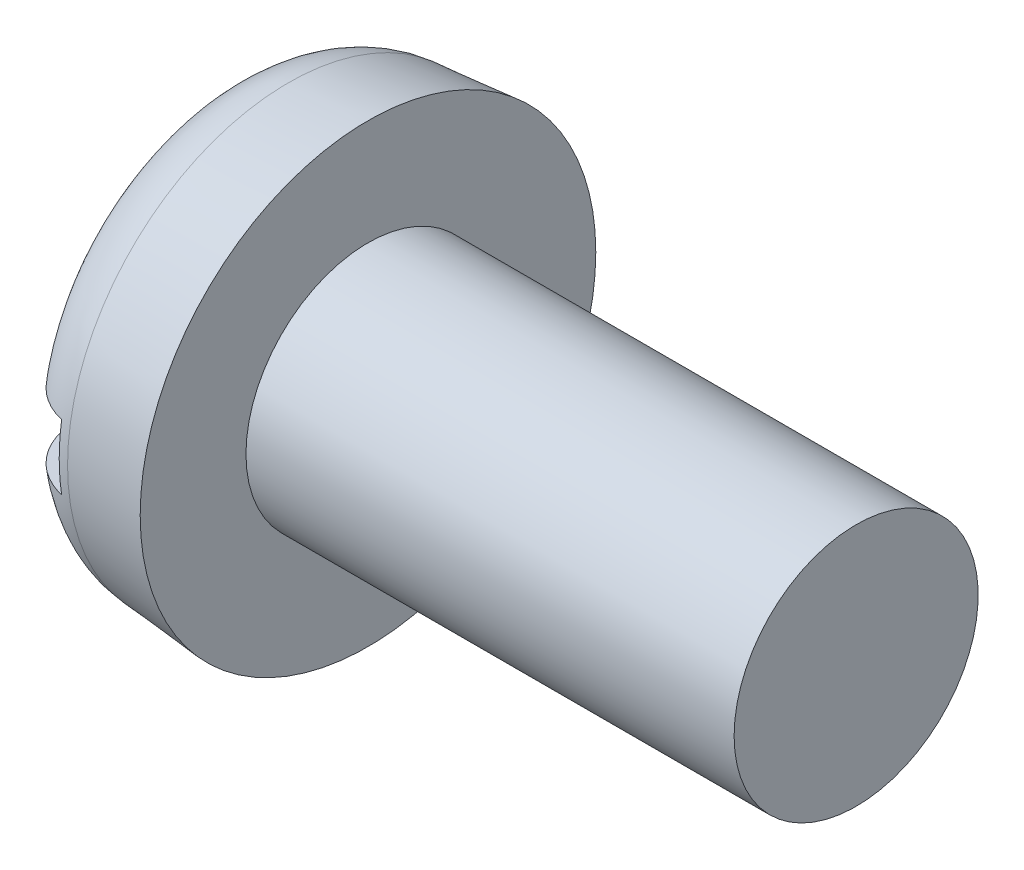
from build123d import *

# Parameters (mm, degrees)
FILLET2_R  = 0.9
SKETCH2_W  = 5.6
SKETCH2_H  = 0.8
SLOT_DEPTH = 0.7


with BuildPart() as part:
    # BodySke → Base-Revolve (revolve)
    with BuildSketch(Plane.XY, mode=Mode.PRIVATE) as base_revolve_sk:
        Polygon((1.8, 1.5), (1.8, 2.8), (0, 2.642520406), (0, 0), (7.8, 0), (7.8, 1.5), align=None)
    revolve(base_revolve_sk.sketch.rotate(Axis((-25.4, 0, 0), (1, 0, 0)), 90), axis=Axis((-25.4, 0, 0), (1, 0, 0)))

    # Fillet2
    fillet2_edges = [part.edges().sort_by_distance(p)[0] for p in [
        (0, 0, -2.642520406),
    ]]
    fillet(fillet2_edges, radius=FILLET2_R)

    # Sketch2 → Slot (cut)
    with BuildSketch(Plane(origin=(0, 0, 0), x_dir=(0, 0, -1), z_dir=(1, 0, 0))):
        Rectangle(SKETCH2_W, SKETCH2_H)
    extrude(amount=SLOT_DEPTH, mode=Mode.SUBTRACT)


solid = part.part
